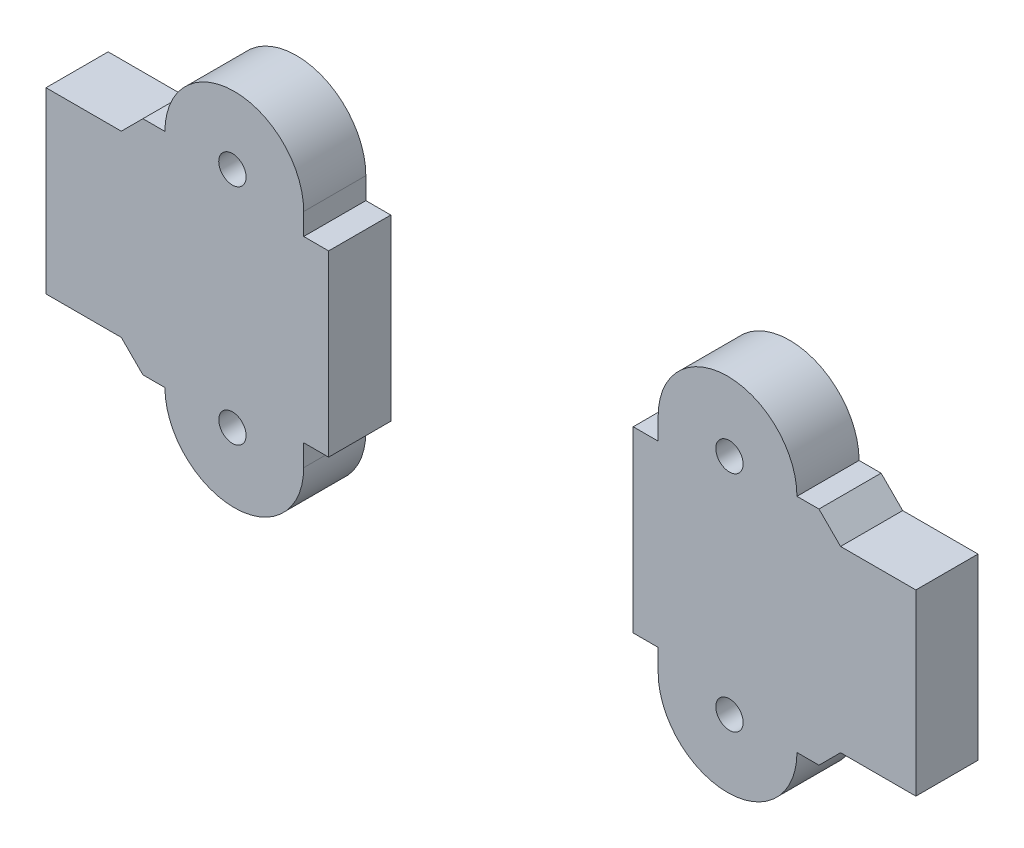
ISO-10303-21;
HEADER;
FILE_DESCRIPTION(('STEP AP214'),'2;1');
FILE_NAME('part.step','',(''),(''),'','','');
FILE_SCHEMA(('AUTOMOTIVE_DESIGN { 1 0 10303 214 1 1 1 1 }'));
ENDSEC;
DATA;
#1=APPLICATION_CONTEXT('core data for automotive mechanical design processes');
#2=APPLICATION_PROTOCOL_DEFINITION('international standard','automotive_design',2000,#1);
#3=PRODUCT_CONTEXT('',#1,'mechanical');
#4=PRODUCT('Part','Part','',(#3));
#5=PRODUCT_RELATED_PRODUCT_CATEGORY('part','',(#4));
#6=PRODUCT_DEFINITION_FORMATION('','',#4);
#7=PRODUCT_DEFINITION_CONTEXT('part definition',#1,'design');
#8=PRODUCT_DEFINITION('design','',#6,#7);
#9=PRODUCT_DEFINITION_SHAPE('','',#8);
#10=(LENGTH_UNIT() NAMED_UNIT(*) SI_UNIT(.MILLI.,.METRE.));
#11=(NAMED_UNIT(*) PLANE_ANGLE_UNIT() SI_UNIT($,.RADIAN.));
#12=(NAMED_UNIT(*) SI_UNIT($,.STERADIAN.) SOLID_ANGLE_UNIT());
#13=UNCERTAINTY_MEASURE_WITH_UNIT(LENGTH_MEASURE(1.E-05),#10,'distance_accuracy_value','');
#14=(GEOMETRIC_REPRESENTATION_CONTEXT(3) GLOBAL_UNCERTAINTY_ASSIGNED_CONTEXT((#13)) GLOBAL_UNIT_ASSIGNED_CONTEXT((#10,
#11,#12)) REPRESENTATION_CONTEXT('',''));
#15=CARTESIAN_POINT('',(0.,0.,0.));
#16=DIRECTION('',(0.,0.,1.));
#17=DIRECTION('',(1.,0.,0.));
#18=AXIS2_PLACEMENT_3D('',#15,#16,#17);
#19=CARTESIAN_POINT('',(19.8462022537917,-23.9261539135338,5.));
#20=DIRECTION('',(0.,0.,-1.));
#21=DIRECTION('',(-1.,0.,0.));
#22=AXIS2_PLACEMENT_3D('',#19,#20,#21);
#23=PLANE('',#22);
#24=DIRECTION('',(0.,1.,0.));
#25=VECTOR('',#24,1.);
#26=CARTESIAN_POINT('',(35.,-7.81316528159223,5.));
#27=LINE('',#26,#25);
#28=CARTESIAN_POINT('',(35.,-22.1868347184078,5.));
#29=VERTEX_POINT('',#28);
#30=CARTESIAN_POINT('',(35.,-7.81316528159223,5.));
#31=VERTEX_POINT('',#30);
#32=EDGE_CURVE('E210',#29,#31,#27,.T.);
#33=ORIENTED_EDGE('',*,*,#32,.T.);
#34=DIRECTION('',(-1.,0.,0.));
#35=VECTOR('',#34,1.);
#36=CARTESIAN_POINT('',(35.,-7.81316528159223,5.));
#37=LINE('',#36,#35);
#38=CARTESIAN_POINT('',(28.9407235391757,-7.81316528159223,5.));
#39=VERTEX_POINT('',#38);
#40=EDGE_CURVE('E107',#31,#39,#37,.T.);
#41=ORIENTED_EDGE('',*,*,#40,.T.);
#42=DIRECTION('',(-0.707106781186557,0.707106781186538,0.));
#43=VECTOR('',#42,1.);
#44=CARTESIAN_POINT('',(28.9407235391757,-7.81316528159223,5.));
#45=LINE('',#44,#43);
#46=CARTESIAN_POINT('',(27.2014043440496,-6.07384608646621,5.));
#47=VERTEX_POINT('',#46);
#48=EDGE_CURVE('E207',#39,#47,#45,.T.);
#49=ORIENTED_EDGE('',*,*,#48,.T.);
#50=DIRECTION('',(-1.,0.,0.));
#51=VECTOR('',#50,1.);
#52=CARTESIAN_POINT('',(27.2014043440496,-6.07384608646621,5.));
#53=LINE('',#52,#51);
#54=CARTESIAN_POINT('',(25.4308750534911,-6.07384608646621,5.));
#55=VERTEX_POINT('',#54);
#56=EDGE_CURVE('E167',#47,#55,#53,.T.);
#57=ORIENTED_EDGE('',*,*,#56,.T.);
#58=CARTESIAN_POINT('',(19.8462022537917,-6.07384608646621,5.));
#59=DIRECTION('',(0.,0.,1.));
#60=DIRECTION('',(1.,0.,0.));
#61=AXIS2_PLACEMENT_3D('',#58,#59,#60);
#62=CIRCLE('',#61,5.58467279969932);
#63=CARTESIAN_POINT('',(14.2615294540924,-6.07384608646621,5.));
#64=VERTEX_POINT('',#63);
#65=EDGE_CURVE('E204',#55,#64,#62,.T.);
#66=ORIENTED_EDGE('',*,*,#65,.T.);
#67=DIRECTION('',(0.,-1.,0.));
#68=VECTOR('',#67,1.);
#69=CARTESIAN_POINT('',(14.2615294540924,-6.07384608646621,5.));
#70=LINE('',#69,#68);
#71=CARTESIAN_POINT('',(14.2615294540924,-7.81316528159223,5.));
#72=VERTEX_POINT('',#71);
#73=EDGE_CURVE('E202',#64,#72,#70,.T.);
#74=ORIENTED_EDGE('',*,*,#73,.T.);
#75=DIRECTION('',(-1.,0.,0.));
#76=VECTOR('',#75,1.);
#77=CARTESIAN_POINT('',(14.2615294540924,-7.81316528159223,5.));
#78=LINE('',#77,#76);
#79=CARTESIAN_POINT('',(12.2549903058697,-7.81316528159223,5.));
#80=VERTEX_POINT('',#79);
#81=EDGE_CURVE('E200',#72,#80,#78,.T.);
#82=ORIENTED_EDGE('',*,*,#81,.T.);
#83=DIRECTION('',(0.,-1.,0.));
#84=VECTOR('',#83,1.);
#85=CARTESIAN_POINT('',(12.2549903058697,-22.1868347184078,5.));
#86=LINE('',#85,#84);
#87=CARTESIAN_POINT('',(12.2549903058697,-22.1868347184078,5.));
#88=VERTEX_POINT('',#87);
#89=EDGE_CURVE('E198',#80,#88,#86,.T.);
#90=ORIENTED_EDGE('',*,*,#89,.T.);
#91=DIRECTION('',(1.,0.,0.));
#92=VECTOR('',#91,1.);
#93=CARTESIAN_POINT('',(14.2615294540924,-22.1868347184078,5.));
#94=LINE('',#93,#92);
#95=CARTESIAN_POINT('',(14.2615294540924,-22.1868347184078,5.));
#96=VERTEX_POINT('',#95);
#97=EDGE_CURVE('E196',#88,#96,#94,.T.);
#98=ORIENTED_EDGE('',*,*,#97,.T.);
#99=DIRECTION('',(0.,-1.,0.));
#100=VECTOR('',#99,1.);
#101=CARTESIAN_POINT('',(14.2615294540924,-23.9261539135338,5.));
#102=LINE('',#101,#100);
#103=CARTESIAN_POINT('',(14.2615294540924,-23.9261539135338,5.));
#104=VERTEX_POINT('',#103);
#105=EDGE_CURVE('E194',#96,#104,#102,.T.);
#106=ORIENTED_EDGE('',*,*,#105,.T.);
#107=CARTESIAN_POINT('',(19.8462022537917,-23.9261539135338,5.));
#108=DIRECTION('',(0.,0.,1.));
#109=DIRECTION('',(-1.,0.,0.));
#110=AXIS2_PLACEMENT_3D('',#107,#108,#109);
#111=CIRCLE('',#110,5.58467279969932);
#112=CARTESIAN_POINT('',(25.4308750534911,-23.9261539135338,5.));
#113=VERTEX_POINT('',#112);
#114=EDGE_CURVE('E192',#104,#113,#111,.T.);
#115=ORIENTED_EDGE('',*,*,#114,.T.);
#116=DIRECTION('',(1.,0.,0.));
#117=VECTOR('',#116,1.);
#118=CARTESIAN_POINT('',(27.2014043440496,-23.9261539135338,5.));
#119=LINE('',#118,#117);
#120=CARTESIAN_POINT('',(27.2014043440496,-23.9261539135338,5.));
#121=VERTEX_POINT('',#120);
#122=EDGE_CURVE('E190',#113,#121,#119,.T.);
#123=ORIENTED_EDGE('',*,*,#122,.T.);
#124=DIRECTION('',(0.707106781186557,0.707106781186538,0.));
#125=VECTOR('',#124,1.);
#126=CARTESIAN_POINT('',(28.9407235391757,-22.1868347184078,5.));
#127=LINE('',#126,#125);
#128=CARTESIAN_POINT('',(28.9407235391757,-22.1868347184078,5.));
#129=VERTEX_POINT('',#128);
#130=EDGE_CURVE('E187',#121,#129,#127,.T.);
#131=ORIENTED_EDGE('',*,*,#130,.T.);
#132=DIRECTION('',(1.,0.,0.));
#133=VECTOR('',#132,1.);
#134=CARTESIAN_POINT('',(35.,-22.1868347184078,5.));
#135=LINE('',#134,#133);
#136=EDGE_CURVE('E185',#129,#29,#135,.T.);
#137=ORIENTED_EDGE('',*,*,#136,.T.);
#138=EDGE_LOOP('',(#33,#41,#49,#57,#66,#74,#82,#90,#98,#106,#115,#123,#131,#137));
#139=FACE_BOUND('',#138,.T.);
#140=CARTESIAN_POINT('',(20.,-5.9999999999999,5.));
#141=DIRECTION('',(0.,0.,1.));
#142=DIRECTION('',(1.,0.,0.));
#143=AXIS2_PLACEMENT_3D('',#140,#141,#142);
#144=CIRCLE('',#143,1.1);
#145=CARTESIAN_POINT('',(21.1,-5.9999999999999,5.));
#146=VERTEX_POINT('',#145);
#147=EDGE_CURVE('E184',#146,#146,#144,.T.);
#148=ORIENTED_EDGE('',*,*,#147,.F.);
#149=EDGE_LOOP('',(#148));
#150=FACE_BOUND('',#149,.T.);
#151=CARTESIAN_POINT('',(20.,-24.0000000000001,5.));
#152=DIRECTION('',(0.,0.,1.));
#153=DIRECTION('',(-1.,0.,0.));
#154=AXIS2_PLACEMENT_3D('',#151,#152,#153);
#155=CIRCLE('',#154,1.1);
#156=CARTESIAN_POINT('',(18.9,-24.0000000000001,5.));
#157=VERTEX_POINT('',#156);
#158=EDGE_CURVE('E48',#157,#157,#155,.T.);
#159=ORIENTED_EDGE('',*,*,#158,.F.);
#160=EDGE_LOOP('',(#159));
#161=FACE_BOUND('',#160,.T.);
#162=ADVANCED_FACE('F44',(#139,#150,#161),#23,.F.);
#163=CARTESIAN_POINT('',(19.8462022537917,-23.9261539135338,0.));
#164=DIRECTION('',(0.,0.,-1.));
#165=DIRECTION('',(-1.,0.,0.));
#166=AXIS2_PLACEMENT_3D('',#163,#164,#165);
#167=PLANE('',#166);
#168=CARTESIAN_POINT('',(20.,-5.9999999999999,0.));
#169=DIRECTION('',(0.,0.,1.));
#170=DIRECTION('',(1.,0.,0.));
#171=AXIS2_PLACEMENT_3D('',#168,#169,#170);
#172=CIRCLE('',#171,1.1);
#173=CARTESIAN_POINT('',(21.1,-5.9999999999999,0.));
#174=VERTEX_POINT('',#173);
#175=EDGE_CURVE('E212',#174,#174,#172,.T.);
#176=ORIENTED_EDGE('',*,*,#175,.T.);
#177=EDGE_LOOP('',(#176));
#178=FACE_BOUND('',#177,.T.);
#179=DIRECTION('',(0.,1.,0.));
#180=VECTOR('',#179,1.);
#181=CARTESIAN_POINT('',(35.,-7.81316528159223,0.));
#182=LINE('',#181,#180);
#183=CARTESIAN_POINT('',(35.,-22.1868347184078,0.));
#184=VERTEX_POINT('',#183);
#185=CARTESIAN_POINT('',(35.,-7.81316528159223,0.));
#186=VERTEX_POINT('',#185);
#187=EDGE_CURVE('E181',#184,#186,#182,.T.);
#188=ORIENTED_EDGE('',*,*,#187,.F.);
#189=DIRECTION('',(1.,0.,0.));
#190=VECTOR('',#189,1.);
#191=CARTESIAN_POINT('',(35.,-22.1868347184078,0.));
#192=LINE('',#191,#190);
#193=CARTESIAN_POINT('',(28.9407235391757,-22.1868347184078,0.));
#194=VERTEX_POINT('',#193);
#195=EDGE_CURVE('E118',#194,#184,#192,.T.);
#196=ORIENTED_EDGE('',*,*,#195,.F.);
#197=DIRECTION('',(0.707106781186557,0.707106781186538,0.));
#198=VECTOR('',#197,1.);
#199=CARTESIAN_POINT('',(28.9407235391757,-22.1868347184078,0.));
#200=LINE('',#199,#198);
#201=CARTESIAN_POINT('',(27.2014043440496,-23.9261539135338,0.));
#202=VERTEX_POINT('',#201);
#203=EDGE_CURVE('E300',#202,#194,#200,.T.);
#204=ORIENTED_EDGE('',*,*,#203,.F.);
#205=DIRECTION('',(1.,0.,0.));
#206=VECTOR('',#205,1.);
#207=CARTESIAN_POINT('',(27.2014043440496,-23.9261539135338,0.));
#208=LINE('',#207,#206);
#209=CARTESIAN_POINT('',(25.4308750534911,-23.9261539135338,0.));
#210=VERTEX_POINT('',#209);
#211=EDGE_CURVE('E302',#210,#202,#208,.T.);
#212=ORIENTED_EDGE('',*,*,#211,.F.);
#213=CARTESIAN_POINT('',(19.8462022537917,-23.9261539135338,0.));
#214=DIRECTION('',(0.,0.,1.));
#215=DIRECTION('',(-1.,0.,0.));
#216=AXIS2_PLACEMENT_3D('',#213,#214,#215);
#217=CIRCLE('',#216,5.58467279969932);
#218=CARTESIAN_POINT('',(14.2615294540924,-23.9261539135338,0.));
#219=VERTEX_POINT('',#218);
#220=EDGE_CURVE('E308',#219,#210,#217,.T.);
#221=ORIENTED_EDGE('',*,*,#220,.F.);
#222=DIRECTION('',(0.,-1.,0.));
#223=VECTOR('',#222,1.);
#224=CARTESIAN_POINT('',(14.2615294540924,-23.9261539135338,0.));
#225=LINE('',#224,#223);
#226=CARTESIAN_POINT('',(14.2615294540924,-22.1868347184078,0.));
#227=VERTEX_POINT('',#226);
#228=EDGE_CURVE('E310',#227,#219,#225,.T.);
#229=ORIENTED_EDGE('',*,*,#228,.F.);
#230=DIRECTION('',(1.,0.,0.));
#231=VECTOR('',#230,1.);
#232=CARTESIAN_POINT('',(14.2615294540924,-22.1868347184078,0.));
#233=LINE('',#232,#231);
#234=CARTESIAN_POINT('',(12.2549903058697,-22.1868347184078,0.));
#235=VERTEX_POINT('',#234);
#236=EDGE_CURVE('E312',#235,#227,#233,.T.);
#237=ORIENTED_EDGE('',*,*,#236,.F.);
#238=DIRECTION('',(0.,-1.,0.));
#239=VECTOR('',#238,1.);
#240=CARTESIAN_POINT('',(12.2549903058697,-22.1868347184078,0.));
#241=LINE('',#240,#239);
#242=CARTESIAN_POINT('',(12.2549903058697,-7.81316528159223,0.));
#243=VERTEX_POINT('',#242);
#244=EDGE_CURVE('E314',#243,#235,#241,.T.);
#245=ORIENTED_EDGE('',*,*,#244,.F.);
#246=DIRECTION('',(-1.,0.,0.));
#247=VECTOR('',#246,1.);
#248=CARTESIAN_POINT('',(14.2615294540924,-7.81316528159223,0.));
#249=LINE('',#248,#247);
#250=CARTESIAN_POINT('',(14.2615294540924,-7.81316528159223,0.));
#251=VERTEX_POINT('',#250);
#252=EDGE_CURVE('E316',#251,#243,#249,.T.);
#253=ORIENTED_EDGE('',*,*,#252,.F.);
#254=DIRECTION('',(0.,-1.,0.));
#255=VECTOR('',#254,1.);
#256=CARTESIAN_POINT('',(14.2615294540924,-6.07384608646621,0.));
#257=LINE('',#256,#255);
#258=CARTESIAN_POINT('',(14.2615294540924,-6.07384608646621,0.));
#259=VERTEX_POINT('',#258);
#260=EDGE_CURVE('E176',#259,#251,#257,.T.);
#261=ORIENTED_EDGE('',*,*,#260,.F.);
#262=CARTESIAN_POINT('',(19.8462022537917,-6.07384608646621,0.));
#263=DIRECTION('',(0.,0.,1.));
#264=DIRECTION('',(1.,0.,0.));
#265=AXIS2_PLACEMENT_3D('',#262,#263,#264);
#266=CIRCLE('',#265,5.58467279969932);
#267=CARTESIAN_POINT('',(25.4308750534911,-6.07384608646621,0.));
#268=VERTEX_POINT('',#267);
#269=EDGE_CURVE('E174',#268,#259,#266,.T.);
#270=ORIENTED_EDGE('',*,*,#269,.F.);
#271=DIRECTION('',(-1.,0.,0.));
#272=VECTOR('',#271,1.);
#273=CARTESIAN_POINT('',(27.2014043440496,-6.07384608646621,0.));
#274=LINE('',#273,#272);
#275=CARTESIAN_POINT('',(27.2014043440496,-6.07384608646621,0.));
#276=VERTEX_POINT('',#275);
#277=EDGE_CURVE('E161',#276,#268,#274,.T.);
#278=ORIENTED_EDGE('',*,*,#277,.F.);
#279=DIRECTION('',(-0.707106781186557,0.707106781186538,0.));
#280=VECTOR('',#279,1.);
#281=CARTESIAN_POINT('',(28.9407235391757,-7.81316528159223,0.));
#282=LINE('',#281,#280);
#283=CARTESIAN_POINT('',(28.9407235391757,-7.81316528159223,0.));
#284=VERTEX_POINT('',#283);
#285=EDGE_CURVE('E153',#284,#276,#282,.T.);
#286=ORIENTED_EDGE('',*,*,#285,.F.);
#287=DIRECTION('',(-1.,0.,0.));
#288=VECTOR('',#287,1.);
#289=CARTESIAN_POINT('',(35.,-7.81316528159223,0.));
#290=LINE('',#289,#288);
#291=EDGE_CURVE('E61',#186,#284,#290,.T.);
#292=ORIENTED_EDGE('',*,*,#291,.F.);
#293=EDGE_LOOP('',(#188,#196,#204,#212,#221,#229,#237,#245,#253,#261,#270,#278,#286,#292));
#294=FACE_BOUND('',#293,.T.);
#295=CARTESIAN_POINT('',(20.,-24.0000000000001,0.));
#296=DIRECTION('',(0.,0.,1.));
#297=DIRECTION('',(-1.,0.,0.));
#298=AXIS2_PLACEMENT_3D('',#295,#296,#297);
#299=CIRCLE('',#298,1.1);
#300=CARTESIAN_POINT('',(18.9,-24.0000000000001,0.));
#301=VERTEX_POINT('',#300);
#302=EDGE_CURVE('E12',#301,#301,#299,.T.);
#303=ORIENTED_EDGE('',*,*,#302,.T.);
#304=EDGE_LOOP('',(#303));
#305=FACE_BOUND('',#304,.T.);
#306=ADVANCED_FACE('F171',(#178,#294,#305),#167,.T.);
#307=CARTESIAN_POINT('',(35.,-7.81316528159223,5.));
#308=DIRECTION('',(-1.,0.,0.));
#309=DIRECTION('',(0.,0.,1.));
#310=AXIS2_PLACEMENT_3D('',#307,#308,#309);
#311=PLANE('',#310);
#312=ORIENTED_EDGE('',*,*,#187,.T.);
#313=DIRECTION('',(0.,0.,-1.));
#314=VECTOR('',#313,1.);
#315=CARTESIAN_POINT('',(35.,-7.81316528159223,5.));
#316=LINE('',#315,#314);
#317=EDGE_CURVE('E295',#31,#186,#316,.T.);
#318=ORIENTED_EDGE('',*,*,#317,.F.);
#319=ORIENTED_EDGE('',*,*,#32,.F.);
#320=DIRECTION('',(0.,0.,-1.));
#321=VECTOR('',#320,1.);
#322=CARTESIAN_POINT('',(35.,-22.1868347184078,5.));
#323=LINE('',#322,#321);
#324=EDGE_CURVE('E188',#29,#184,#323,.T.);
#325=ORIENTED_EDGE('',*,*,#324,.T.);
#326=EDGE_LOOP('',(#312,#318,#319,#325));
#327=FACE_BOUND('',#326,.T.);
#328=ADVANCED_FACE('F231',(#327),#311,.F.);
#329=CARTESIAN_POINT('',(35.,-7.81316528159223,5.));
#330=DIRECTION('',(0.,-1.,0.));
#331=DIRECTION('',(0.,0.,-1.));
#332=AXIS2_PLACEMENT_3D('',#329,#330,#331);
#333=PLANE('',#332);
#334=ORIENTED_EDGE('',*,*,#291,.T.);
#335=DIRECTION('',(0.,0.,-1.));
#336=VECTOR('',#335,1.);
#337=CARTESIAN_POINT('',(28.9407235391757,-7.81316528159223,5.));
#338=LINE('',#337,#336);
#339=EDGE_CURVE('E159',#39,#284,#338,.T.);
#340=ORIENTED_EDGE('',*,*,#339,.F.);
#341=ORIENTED_EDGE('',*,*,#40,.F.);
#342=ORIENTED_EDGE('',*,*,#317,.T.);
#343=EDGE_LOOP('',(#334,#340,#341,#342));
#344=FACE_BOUND('',#343,.T.);
#345=ADVANCED_FACE('F237',(#344),#333,.F.);
#346=CARTESIAN_POINT('',(28.9407235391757,-7.81316528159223,5.));
#347=DIRECTION('',(-0.707106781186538,-0.707106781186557,0.));
#348=DIRECTION('',(0.707106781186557,-0.707106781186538,0.));
#349=AXIS2_PLACEMENT_3D('',#346,#347,#348);
#350=PLANE('',#349);
#351=ORIENTED_EDGE('',*,*,#285,.T.);
#352=DIRECTION('',(0.,0.,-1.));
#353=VECTOR('',#352,1.);
#354=CARTESIAN_POINT('',(27.2014043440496,-6.07384608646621,5.));
#355=LINE('',#354,#353);
#356=EDGE_CURVE('E157',#47,#276,#355,.T.);
#357=ORIENTED_EDGE('',*,*,#356,.F.);
#358=ORIENTED_EDGE('',*,*,#48,.F.);
#359=ORIENTED_EDGE('',*,*,#339,.T.);
#360=EDGE_LOOP('',(#351,#357,#358,#359));
#361=FACE_BOUND('',#360,.T.);
#362=ADVANCED_FACE('F155',(#361),#350,.F.);
#363=CARTESIAN_POINT('',(27.2014043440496,-6.07384608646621,5.));
#364=DIRECTION('',(0.,-1.,0.));
#365=DIRECTION('',(0.,0.,-1.));
#366=AXIS2_PLACEMENT_3D('',#363,#364,#365);
#367=PLANE('',#366);
#368=ORIENTED_EDGE('',*,*,#277,.T.);
#369=DIRECTION('',(0.,0.,-1.));
#370=VECTOR('',#369,1.);
#371=CARTESIAN_POINT('',(25.4308750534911,-6.07384608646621,5.));
#372=LINE('',#371,#370);
#373=EDGE_CURVE('E168',#55,#268,#372,.T.);
#374=ORIENTED_EDGE('',*,*,#373,.F.);
#375=ORIENTED_EDGE('',*,*,#56,.F.);
#376=ORIENTED_EDGE('',*,*,#356,.T.);
#377=EDGE_LOOP('',(#368,#374,#375,#376));
#378=FACE_BOUND('',#377,.T.);
#379=ADVANCED_FACE('F164',(#378),#367,.F.);
#380=CARTESIAN_POINT('',(19.8462022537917,-6.07384608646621,5.));
#381=DIRECTION('',(0.,0.,-1.));
#382=DIRECTION('',(-1.,0.,0.));
#383=AXIS2_PLACEMENT_3D('',#380,#381,#382);
#384=CYLINDRICAL_SURFACE('',#383,5.58467279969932);
#385=ORIENTED_EDGE('',*,*,#269,.T.);
#386=DIRECTION('',(0.,0.,-1.));
#387=VECTOR('',#386,1.);
#388=CARTESIAN_POINT('',(14.2615294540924,-6.07384608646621,5.));
#389=LINE('',#388,#387);
#390=EDGE_CURVE('E324',#64,#259,#389,.T.);
#391=ORIENTED_EDGE('',*,*,#390,.F.);
#392=ORIENTED_EDGE('',*,*,#65,.F.);
#393=ORIENTED_EDGE('',*,*,#373,.T.);
#394=EDGE_LOOP('',(#385,#391,#392,#393));
#395=FACE_BOUND('',#394,.T.);
#396=ADVANCED_FACE('F282',(#395),#384,.T.);
#397=CARTESIAN_POINT('',(14.2615294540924,-6.07384608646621,5.));
#398=DIRECTION('',(1.,0.,0.));
#399=DIRECTION('',(0.,0.,-1.));
#400=AXIS2_PLACEMENT_3D('',#397,#398,#399);
#401=PLANE('',#400);
#402=ORIENTED_EDGE('',*,*,#260,.T.);
#403=DIRECTION('',(0.,0.,-1.));
#404=VECTOR('',#403,1.);
#405=CARTESIAN_POINT('',(14.2615294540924,-7.81316528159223,5.));
#406=LINE('',#405,#404);
#407=EDGE_CURVE('E321',#72,#251,#406,.T.);
#408=ORIENTED_EDGE('',*,*,#407,.F.);
#409=ORIENTED_EDGE('',*,*,#73,.F.);
#410=ORIENTED_EDGE('',*,*,#390,.T.);
#411=EDGE_LOOP('',(#402,#408,#409,#410));
#412=FACE_BOUND('',#411,.T.);
#413=ADVANCED_FACE('F278',(#412),#401,.F.);
#414=CARTESIAN_POINT('',(14.2615294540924,-7.81316528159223,5.));
#415=DIRECTION('',(0.,-1.,0.));
#416=DIRECTION('',(0.,0.,-1.));
#417=AXIS2_PLACEMENT_3D('',#414,#415,#416);
#418=PLANE('',#417);
#419=ORIENTED_EDGE('',*,*,#252,.T.);
#420=DIRECTION('',(0.,0.,-1.));
#421=VECTOR('',#420,1.);
#422=CARTESIAN_POINT('',(12.2549903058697,-7.81316528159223,5.));
#423=LINE('',#422,#421);
#424=EDGE_CURVE('E328',#80,#243,#423,.T.);
#425=ORIENTED_EDGE('',*,*,#424,.F.);
#426=ORIENTED_EDGE('',*,*,#81,.F.);
#427=ORIENTED_EDGE('',*,*,#407,.T.);
#428=EDGE_LOOP('',(#419,#425,#426,#427));
#429=FACE_BOUND('',#428,.T.);
#430=ADVANCED_FACE('F274',(#429),#418,.F.);
#431=CARTESIAN_POINT('',(12.2549903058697,-22.1868347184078,5.));
#432=DIRECTION('',(1.,0.,0.));
#433=DIRECTION('',(0.,0.,-1.));
#434=AXIS2_PLACEMENT_3D('',#431,#432,#433);
#435=PLANE('',#434);
#436=ORIENTED_EDGE('',*,*,#244,.T.);
#437=DIRECTION('',(0.,0.,-1.));
#438=VECTOR('',#437,1.);
#439=CARTESIAN_POINT('',(12.2549903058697,-22.1868347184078,5.));
#440=LINE('',#439,#438);
#441=EDGE_CURVE('E336',#88,#235,#440,.T.);
#442=ORIENTED_EDGE('',*,*,#441,.F.);
#443=ORIENTED_EDGE('',*,*,#89,.F.);
#444=ORIENTED_EDGE('',*,*,#424,.T.);
#445=EDGE_LOOP('',(#436,#442,#443,#444));
#446=FACE_BOUND('',#445,.T.);
#447=ADVANCED_FACE('F270',(#446),#435,.F.);
#448=CARTESIAN_POINT('',(14.2615294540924,-22.1868347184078,5.));
#449=DIRECTION('',(0.,1.,0.));
#450=DIRECTION('',(0.,0.,1.));
#451=AXIS2_PLACEMENT_3D('',#448,#449,#450);
#452=PLANE('',#451);
#453=ORIENTED_EDGE('',*,*,#236,.T.);
#454=DIRECTION('',(0.,0.,-1.));
#455=VECTOR('',#454,1.);
#456=CARTESIAN_POINT('',(14.2615294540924,-22.1868347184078,5.));
#457=LINE('',#456,#455);
#458=EDGE_CURVE('E340',#96,#227,#457,.T.);
#459=ORIENTED_EDGE('',*,*,#458,.F.);
#460=ORIENTED_EDGE('',*,*,#97,.F.);
#461=ORIENTED_EDGE('',*,*,#441,.T.);
#462=EDGE_LOOP('',(#453,#459,#460,#461));
#463=FACE_BOUND('',#462,.T.);
#464=ADVANCED_FACE('F266',(#463),#452,.F.);
#465=CARTESIAN_POINT('',(14.2615294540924,-23.9261539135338,5.));
#466=DIRECTION('',(1.,0.,0.));
#467=DIRECTION('',(0.,0.,-1.));
#468=AXIS2_PLACEMENT_3D('',#465,#466,#467);
#469=PLANE('',#468);
#470=ORIENTED_EDGE('',*,*,#228,.T.);
#471=DIRECTION('',(0.,0.,-1.));
#472=VECTOR('',#471,1.);
#473=CARTESIAN_POINT('',(14.2615294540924,-23.9261539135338,5.));
#474=LINE('',#473,#472);
#475=EDGE_CURVE('E342',#104,#219,#474,.T.);
#476=ORIENTED_EDGE('',*,*,#475,.F.);
#477=ORIENTED_EDGE('',*,*,#105,.F.);
#478=ORIENTED_EDGE('',*,*,#458,.T.);
#479=EDGE_LOOP('',(#470,#476,#477,#478));
#480=FACE_BOUND('',#479,.T.);
#481=ADVANCED_FACE('F262',(#480),#469,.F.);
#482=CARTESIAN_POINT('',(19.8462022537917,-23.9261539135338,5.));
#483=DIRECTION('',(0.,0.,-1.));
#484=DIRECTION('',(-1.,0.,0.));
#485=AXIS2_PLACEMENT_3D('',#482,#483,#484);
#486=CYLINDRICAL_SURFACE('',#485,5.58467279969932);
#487=ORIENTED_EDGE('',*,*,#220,.T.);
#488=DIRECTION('',(0.,0.,-1.));
#489=VECTOR('',#488,1.);
#490=CARTESIAN_POINT('',(25.4308750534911,-23.9261539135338,5.));
#491=LINE('',#490,#489);
#492=EDGE_CURVE('E348',#113,#210,#491,.T.);
#493=ORIENTED_EDGE('',*,*,#492,.F.);
#494=ORIENTED_EDGE('',*,*,#114,.F.);
#495=ORIENTED_EDGE('',*,*,#475,.T.);
#496=EDGE_LOOP('',(#487,#493,#494,#495));
#497=FACE_BOUND('',#496,.T.);
#498=ADVANCED_FACE('F256',(#497),#486,.T.);
#499=CARTESIAN_POINT('',(27.2014043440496,-23.9261539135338,5.));
#500=DIRECTION('',(0.,1.,0.));
#501=DIRECTION('',(0.,0.,1.));
#502=AXIS2_PLACEMENT_3D('',#499,#500,#501);
#503=PLANE('',#502);
#504=ORIENTED_EDGE('',*,*,#211,.T.);
#505=DIRECTION('',(0.,0.,-1.));
#506=VECTOR('',#505,1.);
#507=CARTESIAN_POINT('',(27.2014043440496,-23.9261539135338,5.));
#508=LINE('',#507,#506);
#509=EDGE_CURVE('E351',#121,#202,#508,.T.);
#510=ORIENTED_EDGE('',*,*,#509,.F.);
#511=ORIENTED_EDGE('',*,*,#122,.F.);
#512=ORIENTED_EDGE('',*,*,#492,.T.);
#513=EDGE_LOOP('',(#504,#510,#511,#512));
#514=FACE_BOUND('',#513,.T.);
#515=ADVANCED_FACE('F251',(#514),#503,.F.);
#516=CARTESIAN_POINT('',(28.9407235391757,-22.1868347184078,5.));
#517=DIRECTION('',(-0.707106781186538,0.707106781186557,0.));
#518=DIRECTION('',(-0.707106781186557,-0.707106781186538,0.));
#519=AXIS2_PLACEMENT_3D('',#516,#517,#518);
#520=PLANE('',#519);
#521=ORIENTED_EDGE('',*,*,#203,.T.);
#522=DIRECTION('',(0.,0.,-1.));
#523=VECTOR('',#522,1.);
#524=CARTESIAN_POINT('',(28.9407235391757,-22.1868347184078,5.));
#525=LINE('',#524,#523);
#526=EDGE_CURVE('E353',#129,#194,#525,.T.);
#527=ORIENTED_EDGE('',*,*,#526,.F.);
#528=ORIENTED_EDGE('',*,*,#130,.F.);
#529=ORIENTED_EDGE('',*,*,#509,.T.);
#530=EDGE_LOOP('',(#521,#527,#528,#529));
#531=FACE_BOUND('',#530,.T.);
#532=ADVANCED_FACE('F247',(#531),#520,.F.);
#533=CARTESIAN_POINT('',(35.,-22.1868347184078,5.));
#534=DIRECTION('',(0.,1.,0.));
#535=DIRECTION('',(0.,0.,1.));
#536=AXIS2_PLACEMENT_3D('',#533,#534,#535);
#537=PLANE('',#536);
#538=ORIENTED_EDGE('',*,*,#195,.T.);
#539=ORIENTED_EDGE('',*,*,#324,.F.);
#540=ORIENTED_EDGE('',*,*,#136,.F.);
#541=ORIENTED_EDGE('',*,*,#526,.T.);
#542=EDGE_LOOP('',(#538,#539,#540,#541));
#543=FACE_BOUND('',#542,.T.);
#544=ADVANCED_FACE('F241',(#543),#537,.F.);
#545=CARTESIAN_POINT('',(20.,-5.9999999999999,5.));
#546=DIRECTION('',(0.,0.,-1.));
#547=DIRECTION('',(-1.,0.,0.));
#548=AXIS2_PLACEMENT_3D('',#545,#546,#547);
#549=CYLINDRICAL_SURFACE('',#548,1.1);
#550=ORIENTED_EDGE('',*,*,#147,.T.);
#551=EDGE_LOOP('',(#550));
#552=FACE_BOUND('',#551,.T.);
#553=ORIENTED_EDGE('',*,*,#175,.F.);
#554=EDGE_LOOP('',(#553));
#555=FACE_BOUND('',#554,.T.);
#556=ADVANCED_FACE('F218',(#552,#555),#549,.F.);
#557=CARTESIAN_POINT('',(20.,-24.0000000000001,5.));
#558=DIRECTION('',(0.,0.,-1.));
#559=DIRECTION('',(-1.,0.,0.));
#560=AXIS2_PLACEMENT_3D('',#557,#558,#559);
#561=CYLINDRICAL_SURFACE('',#560,1.1);
#562=ORIENTED_EDGE('',*,*,#158,.T.);
#563=EDGE_LOOP('',(#562));
#564=FACE_BOUND('',#563,.T.);
#565=ORIENTED_EDGE('',*,*,#302,.F.);
#566=EDGE_LOOP('',(#565));
#567=FACE_BOUND('',#566,.T.);
#568=ADVANCED_FACE('F46',(#564,#567),#561,.F.);
#569=CLOSED_SHELL('',(#162,#306,#328,#345,#362,#379,#396,#413,#430,#447,#464,#481,#498,#515,
#532,#544,#556,#568));
#570=MANIFOLD_SOLID_BREP('B2',#569);
#571=CARTESIAN_POINT('',(-19.8462022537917,-23.9261539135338,5.));
#572=DIRECTION('',(0.,0.,1.));
#573=DIRECTION('',(1.,0.,0.));
#574=AXIS2_PLACEMENT_3D('',#571,#572,#573);
#575=PLANE('',#574);
#576=CARTESIAN_POINT('',(-20.,-24.0000000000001,5.));
#577=DIRECTION('',(0.,0.,1.));
#578=DIRECTION('',(1.,0.,0.));
#579=AXIS2_PLACEMENT_3D('',#576,#577,#578);
#580=CIRCLE('',#579,1.1);
#581=CARTESIAN_POINT('',(-18.9,-24.0000000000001,5.));
#582=VERTEX_POINT('',#581);
#583=EDGE_CURVE('E642',#582,#582,#580,.T.);
#584=ORIENTED_EDGE('',*,*,#583,.F.);
#585=EDGE_LOOP('',(#584));
#586=FACE_BOUND('',#585,.T.);
#587=DIRECTION('',(0.,-1.,0.));
#588=VECTOR('',#587,1.);
#589=CARTESIAN_POINT('',(-35.,-7.81316528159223,5.));
#590=LINE('',#589,#588);
#591=CARTESIAN_POINT('',(-35.,-7.81316528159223,5.));
#592=VERTEX_POINT('',#591);
#593=CARTESIAN_POINT('',(-35.,-22.1868347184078,5.));
#594=VERTEX_POINT('',#593);
#595=EDGE_CURVE('E665',#592,#594,#590,.T.);
#596=ORIENTED_EDGE('',*,*,#595,.T.);
#597=DIRECTION('',(1.,0.,0.));
#598=VECTOR('',#597,1.);
#599=CARTESIAN_POINT('',(-35.,-22.1868347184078,5.));
#600=LINE('',#599,#598);
#601=CARTESIAN_POINT('',(-28.9407235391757,-22.1868347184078,5.));
#602=VERTEX_POINT('',#601);
#603=EDGE_CURVE('E583',#594,#602,#600,.T.);
#604=ORIENTED_EDGE('',*,*,#603,.T.);
#605=DIRECTION('',(0.707106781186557,-0.707106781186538,0.));
#606=VECTOR('',#605,1.);
#607=CARTESIAN_POINT('',(-28.9407235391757,-22.1868347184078,5.));
#608=LINE('',#607,#606);
#609=CARTESIAN_POINT('',(-27.2014043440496,-23.9261539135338,5.));
#610=VERTEX_POINT('',#609);
#611=EDGE_CURVE('E698',#602,#610,#608,.T.);
#612=ORIENTED_EDGE('',*,*,#611,.T.);
#613=DIRECTION('',(1.,0.,0.));
#614=VECTOR('',#613,1.);
#615=CARTESIAN_POINT('',(-27.2014043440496,-23.9261539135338,5.));
#616=LINE('',#615,#614);
#617=CARTESIAN_POINT('',(-25.4308750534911,-23.9261539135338,5.));
#618=VERTEX_POINT('',#617);
#619=EDGE_CURVE('E717',#610,#618,#616,.T.);
#620=ORIENTED_EDGE('',*,*,#619,.T.);
#621=CARTESIAN_POINT('',(-19.8462022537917,-23.9261539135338,5.));
#622=DIRECTION('',(0.,0.,1.));
#623=DIRECTION('',(1.,0.,0.));
#624=AXIS2_PLACEMENT_3D('',#621,#622,#623);
#625=CIRCLE('',#624,5.58467279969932);
#626=CARTESIAN_POINT('',(-14.2615294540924,-23.9261539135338,5.));
#627=VERTEX_POINT('',#626);
#628=EDGE_CURVE('E714',#618,#627,#625,.T.);
#629=ORIENTED_EDGE('',*,*,#628,.T.);
#630=DIRECTION('',(0.,1.,0.));
#631=VECTOR('',#630,1.);
#632=CARTESIAN_POINT('',(-14.2615294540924,-23.9261539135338,5.));
#633=LINE('',#632,#631);
#634=CARTESIAN_POINT('',(-14.2615294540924,-22.1868347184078,5.));
#635=VERTEX_POINT('',#634);
#636=EDGE_CURVE('E716',#627,#635,#633,.T.);
#637=ORIENTED_EDGE('',*,*,#636,.T.);
#638=DIRECTION('',(1.,0.,0.));
#639=VECTOR('',#638,1.);
#640=CARTESIAN_POINT('',(-14.2615294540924,-22.1868347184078,5.));
#641=LINE('',#640,#639);
#642=CARTESIAN_POINT('',(-12.2549903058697,-22.1868347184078,5.));
#643=VERTEX_POINT('',#642);
#644=EDGE_CURVE('E719',#635,#643,#641,.T.);
#645=ORIENTED_EDGE('',*,*,#644,.T.);
#646=DIRECTION('',(0.,1.,0.));
#647=VECTOR('',#646,1.);
#648=CARTESIAN_POINT('',(-12.2549903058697,-22.1868347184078,5.));
#649=LINE('',#648,#647);
#650=CARTESIAN_POINT('',(-12.2549903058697,-7.81316528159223,5.));
#651=VERTEX_POINT('',#650);
#652=EDGE_CURVE('E725',#643,#651,#649,.T.);
#653=ORIENTED_EDGE('',*,*,#652,.T.);
#654=DIRECTION('',(-1.,0.,0.));
#655=VECTOR('',#654,1.);
#656=CARTESIAN_POINT('',(-14.2615294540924,-7.81316528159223,5.));
#657=LINE('',#656,#655);
#658=CARTESIAN_POINT('',(-14.2615294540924,-7.81316528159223,5.));
#659=VERTEX_POINT('',#658);
#660=EDGE_CURVE('E727',#651,#659,#657,.T.);
#661=ORIENTED_EDGE('',*,*,#660,.T.);
#662=DIRECTION('',(0.,1.,0.));
#663=VECTOR('',#662,1.);
#664=CARTESIAN_POINT('',(-14.2615294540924,-6.07384608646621,5.));
#665=LINE('',#664,#663);
#666=CARTESIAN_POINT('',(-14.2615294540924,-6.07384608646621,5.));
#667=VERTEX_POINT('',#666);
#668=EDGE_CURVE('E729',#659,#667,#665,.T.);
#669=ORIENTED_EDGE('',*,*,#668,.T.);
#670=CARTESIAN_POINT('',(-19.8462022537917,-6.07384608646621,5.));
#671=DIRECTION('',(0.,0.,1.));
#672=DIRECTION('',(-1.,0.,0.));
#673=AXIS2_PLACEMENT_3D('',#670,#671,#672);
#674=CIRCLE('',#673,5.58467279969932);
#675=CARTESIAN_POINT('',(-25.4308750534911,-6.07384608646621,5.));
#676=VERTEX_POINT('',#675);
#677=EDGE_CURVE('E620',#667,#676,#674,.T.);
#678=ORIENTED_EDGE('',*,*,#677,.T.);
#679=DIRECTION('',(-1.,0.,0.));
#680=VECTOR('',#679,1.);
#681=CARTESIAN_POINT('',(-27.2014043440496,-6.07384608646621,5.));
#682=LINE('',#681,#680);
#683=CARTESIAN_POINT('',(-27.2014043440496,-6.07384608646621,5.));
#684=VERTEX_POINT('',#683);
#685=EDGE_CURVE('E614',#676,#684,#682,.T.);
#686=ORIENTED_EDGE('',*,*,#685,.T.);
#687=DIRECTION('',(-0.707106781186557,-0.707106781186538,0.));
#688=VECTOR('',#687,1.);
#689=CARTESIAN_POINT('',(-28.9407235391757,-7.81316528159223,5.));
#690=LINE('',#689,#688);
#691=CARTESIAN_POINT('',(-28.9407235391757,-7.81316528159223,5.));
#692=VERTEX_POINT('',#691);
#693=EDGE_CURVE('E618',#684,#692,#690,.T.);
#694=ORIENTED_EDGE('',*,*,#693,.T.);
#695=DIRECTION('',(-1.,0.,0.));
#696=VECTOR('',#695,1.);
#697=CARTESIAN_POINT('',(-35.,-7.81316528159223,5.));
#698=LINE('',#697,#696);
#699=EDGE_CURVE('E522',#692,#592,#698,.T.);
#700=ORIENTED_EDGE('',*,*,#699,.T.);
#701=EDGE_LOOP('',(#596,#604,#612,#620,#629,#637,#645,#653,#661,#669,#678,#686,#694,#700));
#702=FACE_BOUND('',#701,.T.);
#703=CARTESIAN_POINT('',(-20.,-5.9999999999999,5.));
#704=DIRECTION('',(0.,0.,1.));
#705=DIRECTION('',(-1.,0.,0.));
#706=AXIS2_PLACEMENT_3D('',#703,#704,#705);
#707=CIRCLE('',#706,1.1);
#708=CARTESIAN_POINT('',(-21.1,-5.9999999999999,5.));
#709=VERTEX_POINT('',#708);
#710=EDGE_CURVE('E771',#709,#709,#707,.T.);
#711=ORIENTED_EDGE('',*,*,#710,.F.);
#712=EDGE_LOOP('',(#711));
#713=FACE_BOUND('',#712,.T.);
#714=ADVANCED_FACE('F505',(#586,#702,#713),#575,.T.);
#715=CARTESIAN_POINT('',(-19.8462022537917,-23.9261539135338,0.));
#716=DIRECTION('',(0.,0.,1.));
#717=DIRECTION('',(1.,0.,0.));
#718=AXIS2_PLACEMENT_3D('',#715,#716,#717);
#719=PLANE('',#718);
#720=DIRECTION('',(0.,-1.,0.));
#721=VECTOR('',#720,1.);
#722=CARTESIAN_POINT('',(-35.,-7.81316528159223,0.));
#723=LINE('',#722,#721);
#724=CARTESIAN_POINT('',(-35.,-7.81316528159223,0.));
#725=VERTEX_POINT('',#724);
#726=CARTESIAN_POINT('',(-35.,-22.1868347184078,0.));
#727=VERTEX_POINT('',#726);
#728=EDGE_CURVE('E638',#725,#727,#723,.T.);
#729=ORIENTED_EDGE('',*,*,#728,.F.);
#730=DIRECTION('',(-1.,0.,0.));
#731=VECTOR('',#730,1.);
#732=CARTESIAN_POINT('',(-35.,-7.81316528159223,0.));
#733=LINE('',#732,#731);
#734=CARTESIAN_POINT('',(-28.9407235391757,-7.81316528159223,0.));
#735=VERTEX_POINT('',#734);
#736=EDGE_CURVE('E575',#735,#725,#733,.T.);
#737=ORIENTED_EDGE('',*,*,#736,.F.);
#738=DIRECTION('',(-0.707106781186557,-0.707106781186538,0.));
#739=VECTOR('',#738,1.);
#740=CARTESIAN_POINT('',(-28.9407235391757,-7.81316528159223,0.));
#741=LINE('',#740,#739);
#742=CARTESIAN_POINT('',(-27.2014043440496,-6.07384608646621,0.));
#743=VERTEX_POINT('',#742);
#744=EDGE_CURVE('E569',#743,#735,#741,.T.);
#745=ORIENTED_EDGE('',*,*,#744,.F.);
#746=DIRECTION('',(-1.,0.,0.));
#747=VECTOR('',#746,1.);
#748=CARTESIAN_POINT('',(-27.2014043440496,-6.07384608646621,0.));
#749=LINE('',#748,#747);
#750=CARTESIAN_POINT('',(-25.4308750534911,-6.07384608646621,0.));
#751=VERTEX_POINT('',#750);
#752=EDGE_CURVE('E628',#751,#743,#749,.T.);
#753=ORIENTED_EDGE('',*,*,#752,.F.);
#754=CARTESIAN_POINT('',(-19.8462022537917,-6.07384608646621,0.));
#755=DIRECTION('',(0.,0.,1.));
#756=DIRECTION('',(-1.,0.,0.));
#757=AXIS2_PLACEMENT_3D('',#754,#755,#756);
#758=CIRCLE('',#757,5.58467279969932);
#759=CARTESIAN_POINT('',(-14.2615294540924,-6.07384608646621,0.));
#760=VERTEX_POINT('',#759);
#761=EDGE_CURVE('E660',#760,#751,#758,.T.);
#762=ORIENTED_EDGE('',*,*,#761,.F.);
#763=DIRECTION('',(0.,1.,0.));
#764=VECTOR('',#763,1.);
#765=CARTESIAN_POINT('',(-14.2615294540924,-6.07384608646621,0.));
#766=LINE('',#765,#764);
#767=CARTESIAN_POINT('',(-14.2615294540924,-7.81316528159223,0.));
#768=VERTEX_POINT('',#767);
#769=EDGE_CURVE('E658',#768,#760,#766,.T.);
#770=ORIENTED_EDGE('',*,*,#769,.F.);
#771=DIRECTION('',(-1.,0.,0.));
#772=VECTOR('',#771,1.);
#773=CARTESIAN_POINT('',(-14.2615294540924,-7.81316528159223,0.));
#774=LINE('',#773,#772);
#775=CARTESIAN_POINT('',(-12.2549903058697,-7.81316528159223,0.));
#776=VERTEX_POINT('',#775);
#777=EDGE_CURVE('E656',#776,#768,#774,.T.);
#778=ORIENTED_EDGE('',*,*,#777,.F.);
#779=DIRECTION('',(0.,1.,0.));
#780=VECTOR('',#779,1.);
#781=CARTESIAN_POINT('',(-12.2549903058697,-22.1868347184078,0.));
#782=LINE('',#781,#780);
#783=CARTESIAN_POINT('',(-12.2549903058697,-22.1868347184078,0.));
#784=VERTEX_POINT('',#783);
#785=EDGE_CURVE('E654',#784,#776,#782,.T.);
#786=ORIENTED_EDGE('',*,*,#785,.F.);
#787=DIRECTION('',(1.,0.,0.));
#788=VECTOR('',#787,1.);
#789=CARTESIAN_POINT('',(-14.2615294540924,-22.1868347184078,0.));
#790=LINE('',#789,#788);
#791=CARTESIAN_POINT('',(-14.2615294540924,-22.1868347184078,0.));
#792=VERTEX_POINT('',#791);
#793=EDGE_CURVE('E652',#792,#784,#790,.T.);
#794=ORIENTED_EDGE('',*,*,#793,.F.);
#795=DIRECTION('',(0.,1.,0.));
#796=VECTOR('',#795,1.);
#797=CARTESIAN_POINT('',(-14.2615294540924,-23.9261539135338,0.));
#798=LINE('',#797,#796);
#799=CARTESIAN_POINT('',(-14.2615294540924,-23.9261539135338,0.));
#800=VERTEX_POINT('',#799);
#801=EDGE_CURVE('E650',#800,#792,#798,.T.);
#802=ORIENTED_EDGE('',*,*,#801,.F.);
#803=CARTESIAN_POINT('',(-19.8462022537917,-23.9261539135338,0.));
#804=DIRECTION('',(0.,0.,1.));
#805=DIRECTION('',(1.,0.,0.));
#806=AXIS2_PLACEMENT_3D('',#803,#804,#805);
#807=CIRCLE('',#806,5.58467279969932);
#808=CARTESIAN_POINT('',(-25.4308750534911,-23.9261539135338,0.));
#809=VERTEX_POINT('',#808);
#810=EDGE_CURVE('E648',#809,#800,#807,.T.);
#811=ORIENTED_EDGE('',*,*,#810,.F.);
#812=DIRECTION('',(1.,0.,0.));
#813=VECTOR('',#812,1.);
#814=CARTESIAN_POINT('',(-27.2014043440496,-23.9261539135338,0.));
#815=LINE('',#814,#813);
#816=CARTESIAN_POINT('',(-27.2014043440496,-23.9261539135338,0.));
#817=VERTEX_POINT('',#816);
#818=EDGE_CURVE('E646',#817,#809,#815,.T.);
#819=ORIENTED_EDGE('',*,*,#818,.F.);
#820=DIRECTION('',(0.707106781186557,-0.707106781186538,0.));
#821=VECTOR('',#820,1.);
#822=CARTESIAN_POINT('',(-28.9407235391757,-22.1868347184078,0.));
#823=LINE('',#822,#821);
#824=CARTESIAN_POINT('',(-28.9407235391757,-22.1868347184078,0.));
#825=VERTEX_POINT('',#824);
#826=EDGE_CURVE('E644',#825,#817,#823,.T.);
#827=ORIENTED_EDGE('',*,*,#826,.F.);
#828=DIRECTION('',(1.,0.,0.));
#829=VECTOR('',#828,1.);
#830=CARTESIAN_POINT('',(-35.,-22.1868347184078,0.));
#831=LINE('',#830,#829);
#832=EDGE_CURVE('E641',#727,#825,#831,.T.);
#833=ORIENTED_EDGE('',*,*,#832,.F.);
#834=EDGE_LOOP('',(#729,#737,#745,#753,#762,#770,#778,#786,#794,#802,#811,#819,#827,#833));
#835=FACE_BOUND('',#834,.T.);
#836=CARTESIAN_POINT('',(-20.,-24.0000000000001,0.));
#837=DIRECTION('',(0.,0.,1.));
#838=DIRECTION('',(1.,0.,0.));
#839=AXIS2_PLACEMENT_3D('',#836,#837,#838);
#840=CIRCLE('',#839,1.1);
#841=CARTESIAN_POINT('',(-18.9,-24.0000000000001,0.));
#842=VERTEX_POINT('',#841);
#843=EDGE_CURVE('E777',#842,#842,#840,.T.);
#844=ORIENTED_EDGE('',*,*,#843,.T.);
#845=EDGE_LOOP('',(#844));
#846=FACE_BOUND('',#845,.T.);
#847=CARTESIAN_POINT('',(-20.,-5.9999999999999,0.));
#848=DIRECTION('',(0.,0.,1.));
#849=DIRECTION('',(-1.,0.,0.));
#850=AXIS2_PLACEMENT_3D('',#847,#848,#849);
#851=CIRCLE('',#850,1.1);
#852=CARTESIAN_POINT('',(-21.1,-5.9999999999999,0.));
#853=VERTEX_POINT('',#852);
#854=EDGE_CURVE('E774',#853,#853,#851,.T.);
#855=ORIENTED_EDGE('',*,*,#854,.T.);
#856=EDGE_LOOP('',(#855));
#857=FACE_BOUND('',#856,.T.);
#858=ADVANCED_FACE('F702',(#835,#846,#857),#719,.F.);
#859=CARTESIAN_POINT('',(-35.,-7.81316528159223,5.));
#860=DIRECTION('',(1.,0.,0.));
#861=DIRECTION('',(0.,0.,-1.));
#862=AXIS2_PLACEMENT_3D('',#859,#860,#861);
#863=PLANE('',#862);
#864=ORIENTED_EDGE('',*,*,#728,.T.);
#865=DIRECTION('',(0.,0.,-1.));
#866=VECTOR('',#865,1.);
#867=CARTESIAN_POINT('',(-35.,-22.1868347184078,5.));
#868=LINE('',#867,#866);
#869=EDGE_CURVE('E42',#594,#727,#868,.T.);
#870=ORIENTED_EDGE('',*,*,#869,.F.);
#871=ORIENTED_EDGE('',*,*,#595,.F.);
#872=DIRECTION('',(0.,0.,-1.));
#873=VECTOR('',#872,1.);
#874=CARTESIAN_POINT('',(-35.,-7.81316528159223,5.));
#875=LINE('',#874,#873);
#876=EDGE_CURVE('E634',#592,#725,#875,.T.);
#877=ORIENTED_EDGE('',*,*,#876,.T.);
#878=EDGE_LOOP('',(#864,#870,#871,#877));
#879=FACE_BOUND('',#878,.T.);
#880=ADVANCED_FACE('F507',(#879),#863,.F.);
#881=CARTESIAN_POINT('',(-35.,-22.1868347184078,5.));
#882=DIRECTION('',(0.,1.,0.));
#883=DIRECTION('',(0.,0.,1.));
#884=AXIS2_PLACEMENT_3D('',#881,#882,#883);
#885=PLANE('',#884);
#886=ORIENTED_EDGE('',*,*,#832,.T.);
#887=DIRECTION('',(0.,0.,-1.));
#888=VECTOR('',#887,1.);
#889=CARTESIAN_POINT('',(-28.9407235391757,-22.1868347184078,5.));
#890=LINE('',#889,#888);
#891=EDGE_CURVE('E514',#602,#825,#890,.T.);
#892=ORIENTED_EDGE('',*,*,#891,.F.);
#893=ORIENTED_EDGE('',*,*,#603,.F.);
#894=ORIENTED_EDGE('',*,*,#869,.T.);
#895=EDGE_LOOP('',(#886,#892,#893,#894));
#896=FACE_BOUND('',#895,.T.);
#897=ADVANCED_FACE('F902',(#896),#885,.F.);
#898=CARTESIAN_POINT('',(-28.9407235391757,-22.1868347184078,5.));
#899=DIRECTION('',(0.707106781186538,0.707106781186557,0.));
#900=DIRECTION('',(-0.707106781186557,0.707106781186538,0.));
#901=AXIS2_PLACEMENT_3D('',#898,#899,#900);
#902=PLANE('',#901);
#903=ORIENTED_EDGE('',*,*,#826,.T.);
#904=DIRECTION('',(0.,0.,-1.));
#905=VECTOR('',#904,1.);
#906=CARTESIAN_POINT('',(-27.2014043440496,-23.9261539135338,5.));
#907=LINE('',#906,#905);
#908=EDGE_CURVE('E690',#610,#817,#907,.T.);
#909=ORIENTED_EDGE('',*,*,#908,.F.);
#910=ORIENTED_EDGE('',*,*,#611,.F.);
#911=ORIENTED_EDGE('',*,*,#891,.T.);
#912=EDGE_LOOP('',(#903,#909,#910,#911));
#913=FACE_BOUND('',#912,.T.);
#914=ADVANCED_FACE('F696',(#913),#902,.F.);
#915=CARTESIAN_POINT('',(-27.2014043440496,-23.9261539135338,5.));
#916=DIRECTION('',(0.,1.,0.));
#917=DIRECTION('',(0.,0.,1.));
#918=AXIS2_PLACEMENT_3D('',#915,#916,#917);
#919=PLANE('',#918);
#920=ORIENTED_EDGE('',*,*,#818,.T.);
#921=DIRECTION('',(0.,0.,-1.));
#922=VECTOR('',#921,1.);
#923=CARTESIAN_POINT('',(-25.4308750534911,-23.9261539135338,5.));
#924=LINE('',#923,#922);
#925=EDGE_CURVE('E687',#618,#809,#924,.T.);
#926=ORIENTED_EDGE('',*,*,#925,.F.);
#927=ORIENTED_EDGE('',*,*,#619,.F.);
#928=ORIENTED_EDGE('',*,*,#908,.T.);
#929=EDGE_LOOP('',(#920,#926,#927,#928));
#930=FACE_BOUND('',#929,.T.);
#931=ADVANCED_FACE('F708',(#930),#919,.F.);
#932=CARTESIAN_POINT('',(-19.8462022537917,-23.9261539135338,5.));
#933=DIRECTION('',(0.,0.,-1.));
#934=DIRECTION('',(-1.,0.,0.));
#935=AXIS2_PLACEMENT_3D('',#932,#933,#934);
#936=CYLINDRICAL_SURFACE('',#935,5.58467279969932);
#937=ORIENTED_EDGE('',*,*,#810,.T.);
#938=DIRECTION('',(0.,0.,-1.));
#939=VECTOR('',#938,1.);
#940=CARTESIAN_POINT('',(-14.2615294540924,-23.9261539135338,5.));
#941=LINE('',#940,#939);
#942=EDGE_CURVE('E684',#627,#800,#941,.T.);
#943=ORIENTED_EDGE('',*,*,#942,.F.);
#944=ORIENTED_EDGE('',*,*,#628,.F.);
#945=ORIENTED_EDGE('',*,*,#925,.T.);
#946=EDGE_LOOP('',(#937,#943,#944,#945));
#947=FACE_BOUND('',#946,.T.);
#948=ADVANCED_FACE('F712',(#947),#936,.T.);
#949=CARTESIAN_POINT('',(-14.2615294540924,-23.9261539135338,5.));
#950=DIRECTION('',(-1.,0.,0.));
#951=DIRECTION('',(0.,0.,1.));
#952=AXIS2_PLACEMENT_3D('',#949,#950,#951);
#953=PLANE('',#952);
#954=ORIENTED_EDGE('',*,*,#801,.T.);
#955=DIRECTION('',(0.,0.,-1.));
#956=VECTOR('',#955,1.);
#957=CARTESIAN_POINT('',(-14.2615294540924,-22.1868347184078,5.));
#958=LINE('',#957,#956);
#959=EDGE_CURVE('E681',#635,#792,#958,.T.);
#960=ORIENTED_EDGE('',*,*,#959,.F.);
#961=ORIENTED_EDGE('',*,*,#636,.F.);
#962=ORIENTED_EDGE('',*,*,#942,.T.);
#963=EDGE_LOOP('',(#954,#960,#961,#962));
#964=FACE_BOUND('',#963,.T.);
#965=ADVANCED_FACE('F863',(#964),#953,.F.);
#966=CARTESIAN_POINT('',(-14.2615294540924,-22.1868347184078,5.));
#967=DIRECTION('',(0.,1.,0.));
#968=DIRECTION('',(0.,0.,1.));
#969=AXIS2_PLACEMENT_3D('',#966,#967,#968);
#970=PLANE('',#969);
#971=ORIENTED_EDGE('',*,*,#793,.T.);
#972=DIRECTION('',(0.,0.,-1.));
#973=VECTOR('',#972,1.);
#974=CARTESIAN_POINT('',(-12.2549903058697,-22.1868347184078,5.));
#975=LINE('',#974,#973);
#976=EDGE_CURVE('E678',#643,#784,#975,.T.);
#977=ORIENTED_EDGE('',*,*,#976,.F.);
#978=ORIENTED_EDGE('',*,*,#644,.F.);
#979=ORIENTED_EDGE('',*,*,#959,.T.);
#980=EDGE_LOOP('',(#971,#977,#978,#979));
#981=FACE_BOUND('',#980,.T.);
#982=ADVANCED_FACE('F852',(#981),#970,.F.);
#983=CARTESIAN_POINT('',(-12.2549903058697,-22.1868347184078,5.));
#984=DIRECTION('',(-1.,0.,0.));
#985=DIRECTION('',(0.,0.,1.));
#986=AXIS2_PLACEMENT_3D('',#983,#984,#985);
#987=PLANE('',#986);
#988=ORIENTED_EDGE('',*,*,#785,.T.);
#989=DIRECTION('',(0.,0.,-1.));
#990=VECTOR('',#989,1.);
#991=CARTESIAN_POINT('',(-12.2549903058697,-7.81316528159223,5.));
#992=LINE('',#991,#990);
#993=EDGE_CURVE('E675',#651,#776,#992,.T.);
#994=ORIENTED_EDGE('',*,*,#993,.F.);
#995=ORIENTED_EDGE('',*,*,#652,.F.);
#996=ORIENTED_EDGE('',*,*,#976,.T.);
#997=EDGE_LOOP('',(#988,#994,#995,#996));
#998=FACE_BOUND('',#997,.T.);
#999=ADVANCED_FACE('F841',(#998),#987,.F.);
#1000=CARTESIAN_POINT('',(-14.2615294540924,-7.81316528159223,5.));
#1001=DIRECTION('',(0.,-1.,0.));
#1002=DIRECTION('',(0.,0.,-1.));
#1003=AXIS2_PLACEMENT_3D('',#1000,#1001,#1002);
#1004=PLANE('',#1003);
#1005=ORIENTED_EDGE('',*,*,#777,.T.);
#1006=DIRECTION('',(0.,0.,-1.));
#1007=VECTOR('',#1006,1.);
#1008=CARTESIAN_POINT('',(-14.2615294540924,-7.81316528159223,5.));
#1009=LINE('',#1008,#1007);
#1010=EDGE_CURVE('E672',#659,#768,#1009,.T.);
#1011=ORIENTED_EDGE('',*,*,#1010,.F.);
#1012=ORIENTED_EDGE('',*,*,#660,.F.);
#1013=ORIENTED_EDGE('',*,*,#993,.T.);
#1014=EDGE_LOOP('',(#1005,#1011,#1012,#1013));
#1015=FACE_BOUND('',#1014,.T.);
#1016=ADVANCED_FACE('F831',(#1015),#1004,.F.);
#1017=CARTESIAN_POINT('',(-14.2615294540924,-6.07384608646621,5.));
#1018=DIRECTION('',(-1.,0.,0.));
#1019=DIRECTION('',(0.,0.,1.));
#1020=AXIS2_PLACEMENT_3D('',#1017,#1018,#1019);
#1021=PLANE('',#1020);
#1022=ORIENTED_EDGE('',*,*,#769,.T.);
#1023=DIRECTION('',(0.,0.,-1.));
#1024=VECTOR('',#1023,1.);
#1025=CARTESIAN_POINT('',(-14.2615294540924,-6.07384608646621,5.));
#1026=LINE('',#1025,#1024);
#1027=EDGE_CURVE('E669',#667,#760,#1026,.T.);
#1028=ORIENTED_EDGE('',*,*,#1027,.F.);
#1029=ORIENTED_EDGE('',*,*,#668,.F.);
#1030=ORIENTED_EDGE('',*,*,#1010,.T.);
#1031=EDGE_LOOP('',(#1022,#1028,#1029,#1030));
#1032=FACE_BOUND('',#1031,.T.);
#1033=ADVANCED_FACE('F735',(#1032),#1021,.F.);
#1034=CARTESIAN_POINT('',(-19.8462022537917,-6.07384608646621,5.));
#1035=DIRECTION('',(0.,0.,-1.));
#1036=DIRECTION('',(-1.,0.,0.));
#1037=AXIS2_PLACEMENT_3D('',#1034,#1035,#1036);
#1038=CYLINDRICAL_SURFACE('',#1037,5.58467279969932);
#1039=ORIENTED_EDGE('',*,*,#761,.T.);
#1040=DIRECTION('',(0.,0.,-1.));
#1041=VECTOR('',#1040,1.);
#1042=CARTESIAN_POINT('',(-25.4308750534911,-6.07384608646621,5.));
#1043=LINE('',#1042,#1041);
#1044=EDGE_CURVE('E629',#676,#751,#1043,.T.);
#1045=ORIENTED_EDGE('',*,*,#1044,.F.);
#1046=ORIENTED_EDGE('',*,*,#677,.F.);
#1047=ORIENTED_EDGE('',*,*,#1027,.T.);
#1048=EDGE_LOOP('',(#1039,#1045,#1046,#1047));
#1049=FACE_BOUND('',#1048,.T.);
#1050=ADVANCED_FACE('F739',(#1049),#1038,.T.);
#1051=CARTESIAN_POINT('',(-27.2014043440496,-6.07384608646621,5.));
#1052=DIRECTION('',(0.,-1.,0.));
#1053=DIRECTION('',(0.,0.,-1.));
#1054=AXIS2_PLACEMENT_3D('',#1051,#1052,#1053);
#1055=PLANE('',#1054);
#1056=ORIENTED_EDGE('',*,*,#752,.T.);
#1057=DIRECTION('',(0.,0.,-1.));
#1058=VECTOR('',#1057,1.);
#1059=CARTESIAN_POINT('',(-27.2014043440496,-6.07384608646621,5.));
#1060=LINE('',#1059,#1058);
#1061=EDGE_CURVE('E625',#684,#743,#1060,.T.);
#1062=ORIENTED_EDGE('',*,*,#1061,.F.);
#1063=ORIENTED_EDGE('',*,*,#685,.F.);
#1064=ORIENTED_EDGE('',*,*,#1044,.T.);
#1065=EDGE_LOOP('',(#1056,#1062,#1063,#1064));
#1066=FACE_BOUND('',#1065,.T.);
#1067=ADVANCED_FACE('F626',(#1066),#1055,.F.);
#1068=CARTESIAN_POINT('',(-28.9407235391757,-7.81316528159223,5.));
#1069=DIRECTION('',(0.707106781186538,-0.707106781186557,0.));
#1070=DIRECTION('',(0.707106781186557,0.707106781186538,0.));
#1071=AXIS2_PLACEMENT_3D('',#1068,#1069,#1070);
#1072=PLANE('',#1071);
#1073=ORIENTED_EDGE('',*,*,#744,.T.);
#1074=DIRECTION('',(0.,0.,-1.));
#1075=VECTOR('',#1074,1.);
#1076=CARTESIAN_POINT('',(-28.9407235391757,-7.81316528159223,5.));
#1077=LINE('',#1076,#1075);
#1078=EDGE_CURVE('E630',#692,#735,#1077,.T.);
#1079=ORIENTED_EDGE('',*,*,#1078,.F.);
#1080=ORIENTED_EDGE('',*,*,#693,.F.);
#1081=ORIENTED_EDGE('',*,*,#1061,.T.);
#1082=EDGE_LOOP('',(#1073,#1079,#1080,#1081));
#1083=FACE_BOUND('',#1082,.T.);
#1084=ADVANCED_FACE('F632',(#1083),#1072,.F.);
#1085=CARTESIAN_POINT('',(-35.,-7.81316528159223,5.));
#1086=DIRECTION('',(0.,-1.,0.));
#1087=DIRECTION('',(0.,0.,-1.));
#1088=AXIS2_PLACEMENT_3D('',#1085,#1086,#1087);
#1089=PLANE('',#1088);
#1090=ORIENTED_EDGE('',*,*,#736,.T.);
#1091=ORIENTED_EDGE('',*,*,#876,.F.);
#1092=ORIENTED_EDGE('',*,*,#699,.F.);
#1093=ORIENTED_EDGE('',*,*,#1078,.T.);
#1094=EDGE_LOOP('',(#1090,#1091,#1092,#1093));
#1095=FACE_BOUND('',#1094,.T.);
#1096=ADVANCED_FACE('F743',(#1095),#1089,.F.);
#1097=CARTESIAN_POINT('',(-20.,-24.0000000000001,5.));
#1098=DIRECTION('',(0.,0.,-1.));
#1099=DIRECTION('',(-1.,0.,0.));
#1100=AXIS2_PLACEMENT_3D('',#1097,#1098,#1099);
#1101=CYLINDRICAL_SURFACE('',#1100,1.1);
#1102=ORIENTED_EDGE('',*,*,#583,.T.);
#1103=EDGE_LOOP('',(#1102));
#1104=FACE_BOUND('',#1103,.T.);
#1105=ORIENTED_EDGE('',*,*,#843,.F.);
#1106=EDGE_LOOP('',(#1105));
#1107=FACE_BOUND('',#1106,.T.);
#1108=ADVANCED_FACE('F745',(#1104,#1107),#1101,.F.);
#1109=CARTESIAN_POINT('',(-20.,-5.9999999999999,5.));
#1110=DIRECTION('',(0.,0.,-1.));
#1111=DIRECTION('',(-1.,0.,0.));
#1112=AXIS2_PLACEMENT_3D('',#1109,#1110,#1111);
#1113=CYLINDRICAL_SURFACE('',#1112,1.1);
#1114=ORIENTED_EDGE('',*,*,#710,.T.);
#1115=EDGE_LOOP('',(#1114));
#1116=FACE_BOUND('',#1115,.T.);
#1117=ORIENTED_EDGE('',*,*,#854,.F.);
#1118=EDGE_LOOP('',(#1117));
#1119=FACE_BOUND('',#1118,.T.);
#1120=ADVANCED_FACE('F751',(#1116,#1119),#1113,.F.);
#1121=CLOSED_SHELL('',(#714,#858,#880,#897,#914,#931,#948,#965,#982,#999,#1016,#1033,#1050,
#1067,#1084,#1096,#1108,#1120));
#1122=MANIFOLD_SOLID_BREP('B6',#1121);
#1123=ADVANCED_BREP_SHAPE_REPRESENTATION('',(#18,#570,#1122),#14);
#1124=SHAPE_DEFINITION_REPRESENTATION(#9,#1123);
ENDSEC;
END-ISO-10303-21;
